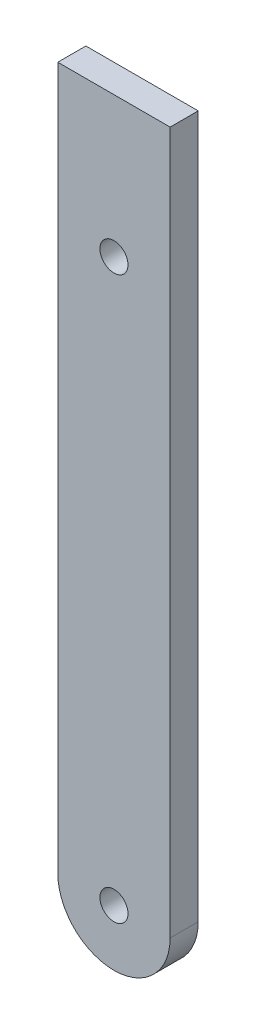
ISO-10303-21;
HEADER;
FILE_DESCRIPTION(('STEP AP214'),'2;1');
FILE_NAME('part.step','',(''),(''),'','','');
FILE_SCHEMA(('AUTOMOTIVE_DESIGN { 1 0 10303 214 1 1 1 1 }'));
ENDSEC;
DATA;
#1=APPLICATION_CONTEXT('core data for automotive mechanical design processes');
#2=APPLICATION_PROTOCOL_DEFINITION('international standard','automotive_design',2000,#1);
#3=PRODUCT_CONTEXT('',#1,'mechanical');
#4=PRODUCT('Part','Part','',(#3));
#5=PRODUCT_RELATED_PRODUCT_CATEGORY('part','',(#4));
#6=PRODUCT_DEFINITION_FORMATION('','',#4);
#7=PRODUCT_DEFINITION_CONTEXT('part definition',#1,'design');
#8=PRODUCT_DEFINITION('design','',#6,#7);
#9=PRODUCT_DEFINITION_SHAPE('','',#8);
#10=(LENGTH_UNIT() NAMED_UNIT(*) SI_UNIT(.MILLI.,.METRE.));
#11=(NAMED_UNIT(*) PLANE_ANGLE_UNIT() SI_UNIT($,.RADIAN.));
#12=(NAMED_UNIT(*) SI_UNIT($,.STERADIAN.) SOLID_ANGLE_UNIT());
#13=UNCERTAINTY_MEASURE_WITH_UNIT(LENGTH_MEASURE(1.E-05),#10,'distance_accuracy_value','');
#14=(GEOMETRIC_REPRESENTATION_CONTEXT(3) GLOBAL_UNCERTAINTY_ASSIGNED_CONTEXT((#13)) GLOBAL_UNIT_ASSIGNED_CONTEXT((#10,
#11,#12)) REPRESENTATION_CONTEXT('',''));
#15=CARTESIAN_POINT('',(0.,0.,0.));
#16=DIRECTION('',(0.,0.,1.));
#17=DIRECTION('',(1.,0.,0.));
#18=AXIS2_PLACEMENT_3D('',#15,#16,#17);
#19=CARTESIAN_POINT('',(0.,0.,5.));
#20=DIRECTION('',(0.,0.,1.));
#21=DIRECTION('',(1.,0.,0.));
#22=AXIS2_PLACEMENT_3D('',#19,#20,#21);
#23=PLANE('',#22);
#24=CARTESIAN_POINT('',(0.,100.,5.));
#25=DIRECTION('',(0.,0.,1.));
#26=DIRECTION('',(1.,0.,0.));
#27=AXIS2_PLACEMENT_3D('',#24,#25,#26);
#28=CIRCLE('',#27,2.5);
#29=CARTESIAN_POINT('',(2.5,100.,5.));
#30=VERTEX_POINT('',#29);
#31=EDGE_CURVE('E103',#30,#30,#28,.T.);
#32=ORIENTED_EDGE('',*,*,#31,.F.);
#33=EDGE_LOOP('',(#32));
#34=FACE_BOUND('',#33,.T.);
#35=CARTESIAN_POINT('',(0.,0.,5.));
#36=DIRECTION('',(0.,0.,1.));
#37=DIRECTION('',(1.,0.,0.));
#38=AXIS2_PLACEMENT_3D('',#35,#36,#37);
#39=CIRCLE('',#38,10.);
#40=CARTESIAN_POINT('',(-10.,0.,5.));
#41=VERTEX_POINT('',#40);
#42=CARTESIAN_POINT('',(10.,0.,5.));
#43=VERTEX_POINT('',#42);
#44=EDGE_CURVE('E88',#41,#43,#39,.T.);
#45=ORIENTED_EDGE('',*,*,#44,.T.);
#46=DIRECTION('',(0.,1.,0.));
#47=VECTOR('',#46,1.);
#48=CARTESIAN_POINT('',(10.,125.,5.));
#49=LINE('',#48,#47);
#50=CARTESIAN_POINT('',(10.,125.,5.));
#51=VERTEX_POINT('',#50);
#52=EDGE_CURVE('E83',#43,#51,#49,.T.);
#53=ORIENTED_EDGE('',*,*,#52,.T.);
#54=DIRECTION('',(-1.,0.,0.));
#55=VECTOR('',#54,1.);
#56=CARTESIAN_POINT('',(-10.,125.,5.));
#57=LINE('',#56,#55);
#58=CARTESIAN_POINT('',(-10.,125.,5.));
#59=VERTEX_POINT('',#58);
#60=EDGE_CURVE('E86',#51,#59,#57,.T.);
#61=ORIENTED_EDGE('',*,*,#60,.T.);
#62=DIRECTION('',(0.,-1.,0.));
#63=VECTOR('',#62,1.);
#64=CARTESIAN_POINT('',(-10.,0.,5.));
#65=LINE('',#64,#63);
#66=EDGE_CURVE('E53',#59,#41,#65,.T.);
#67=ORIENTED_EDGE('',*,*,#66,.T.);
#68=EDGE_LOOP('',(#45,#53,#61,#67));
#69=FACE_BOUND('',#68,.T.);
#70=CARTESIAN_POINT('',(0.,0.,5.));
#71=DIRECTION('',(0.,0.,1.));
#72=DIRECTION('',(1.,0.,0.));
#73=AXIS2_PLACEMENT_3D('',#70,#71,#72);
#74=CIRCLE('',#73,2.5);
#75=CARTESIAN_POINT('',(2.5,0.,5.));
#76=VERTEX_POINT('',#75);
#77=EDGE_CURVE('E118',#76,#76,#74,.T.);
#78=ORIENTED_EDGE('',*,*,#77,.F.);
#79=EDGE_LOOP('',(#78));
#80=FACE_BOUND('',#79,.T.);
#81=ADVANCED_FACE('F36',(#34,#69,#80),#23,.T.);
#82=CARTESIAN_POINT('',(0.,0.,0.));
#83=DIRECTION('',(0.,0.,1.));
#84=DIRECTION('',(1.,0.,0.));
#85=AXIS2_PLACEMENT_3D('',#82,#83,#84);
#86=PLANE('',#85);
#87=CARTESIAN_POINT('',(0.,0.,0.));
#88=DIRECTION('',(0.,0.,1.));
#89=DIRECTION('',(1.,0.,0.));
#90=AXIS2_PLACEMENT_3D('',#87,#88,#89);
#91=CIRCLE('',#90,10.);
#92=CARTESIAN_POINT('',(-10.,0.,0.));
#93=VERTEX_POINT('',#92);
#94=CARTESIAN_POINT('',(10.,0.,0.));
#95=VERTEX_POINT('',#94);
#96=EDGE_CURVE('E100',#93,#95,#91,.T.);
#97=ORIENTED_EDGE('',*,*,#96,.F.);
#98=DIRECTION('',(0.,-1.,0.));
#99=VECTOR('',#98,1.);
#100=CARTESIAN_POINT('',(-10.,0.,0.));
#101=LINE('',#100,#99);
#102=CARTESIAN_POINT('',(-10.,125.,0.));
#103=VERTEX_POINT('',#102);
#104=EDGE_CURVE('E76',#103,#93,#101,.T.);
#105=ORIENTED_EDGE('',*,*,#104,.F.);
#106=DIRECTION('',(-1.,0.,0.));
#107=VECTOR('',#106,1.);
#108=CARTESIAN_POINT('',(-10.,125.,0.));
#109=LINE('',#108,#107);
#110=CARTESIAN_POINT('',(10.,125.,0.));
#111=VERTEX_POINT('',#110);
#112=EDGE_CURVE('E70',#111,#103,#109,.T.);
#113=ORIENTED_EDGE('',*,*,#112,.F.);
#114=DIRECTION('',(0.,1.,0.));
#115=VECTOR('',#114,1.);
#116=CARTESIAN_POINT('',(10.,125.,0.));
#117=LINE('',#116,#115);
#118=EDGE_CURVE('E92',#95,#111,#117,.T.);
#119=ORIENTED_EDGE('',*,*,#118,.F.);
#120=EDGE_LOOP('',(#97,#105,#113,#119));
#121=FACE_BOUND('',#120,.T.);
#122=CARTESIAN_POINT('',(0.,100.,0.));
#123=DIRECTION('',(0.,0.,1.));
#124=DIRECTION('',(1.,0.,0.));
#125=AXIS2_PLACEMENT_3D('',#122,#123,#124);
#126=CIRCLE('',#125,2.5);
#127=CARTESIAN_POINT('',(2.5,100.,0.));
#128=VERTEX_POINT('',#127);
#129=EDGE_CURVE('E115',#128,#128,#126,.T.);
#130=ORIENTED_EDGE('',*,*,#129,.T.);
#131=EDGE_LOOP('',(#130));
#132=FACE_BOUND('',#131,.T.);
#133=CARTESIAN_POINT('',(0.,0.,0.));
#134=DIRECTION('',(0.,0.,1.));
#135=DIRECTION('',(1.,0.,0.));
#136=AXIS2_PLACEMENT_3D('',#133,#134,#135);
#137=CIRCLE('',#136,2.5);
#138=CARTESIAN_POINT('',(2.5,0.,0.));
#139=VERTEX_POINT('',#138);
#140=EDGE_CURVE('E121',#139,#139,#137,.T.);
#141=ORIENTED_EDGE('',*,*,#140,.T.);
#142=EDGE_LOOP('',(#141));
#143=FACE_BOUND('',#142,.T.);
#144=ADVANCED_FACE('F111',(#121,#132,#143),#86,.F.);
#145=CARTESIAN_POINT('',(0.,0.,5.));
#146=DIRECTION('',(0.,0.,-1.));
#147=DIRECTION('',(-1.,0.,0.));
#148=AXIS2_PLACEMENT_3D('',#145,#146,#147);
#149=CYLINDRICAL_SURFACE('',#148,10.);
#150=ORIENTED_EDGE('',*,*,#96,.T.);
#151=DIRECTION('',(0.,0.,-1.));
#152=VECTOR('',#151,1.);
#153=CARTESIAN_POINT('',(10.,0.,5.));
#154=LINE('',#153,#152);
#155=EDGE_CURVE('E11',#43,#95,#154,.T.);
#156=ORIENTED_EDGE('',*,*,#155,.F.);
#157=ORIENTED_EDGE('',*,*,#44,.F.);
#158=DIRECTION('',(0.,0.,-1.));
#159=VECTOR('',#158,1.);
#160=CARTESIAN_POINT('',(-10.,0.,5.));
#161=LINE('',#160,#159);
#162=EDGE_CURVE('E96',#41,#93,#161,.T.);
#163=ORIENTED_EDGE('',*,*,#162,.T.);
#164=EDGE_LOOP('',(#150,#156,#157,#163));
#165=FACE_BOUND('',#164,.T.);
#166=ADVANCED_FACE('F38',(#165),#149,.T.);
#167=CARTESIAN_POINT('',(10.,125.,5.));
#168=DIRECTION('',(-1.,0.,0.));
#169=DIRECTION('',(0.,0.,1.));
#170=AXIS2_PLACEMENT_3D('',#167,#168,#169);
#171=PLANE('',#170);
#172=ORIENTED_EDGE('',*,*,#118,.T.);
#173=DIRECTION('',(0.,0.,-1.));
#174=VECTOR('',#173,1.);
#175=CARTESIAN_POINT('',(10.,125.,5.));
#176=LINE('',#175,#174);
#177=EDGE_CURVE('E45',#51,#111,#176,.T.);
#178=ORIENTED_EDGE('',*,*,#177,.F.);
#179=ORIENTED_EDGE('',*,*,#52,.F.);
#180=ORIENTED_EDGE('',*,*,#155,.T.);
#181=EDGE_LOOP('',(#172,#178,#179,#180));
#182=FACE_BOUND('',#181,.T.);
#183=ADVANCED_FACE('F91',(#182),#171,.F.);
#184=CARTESIAN_POINT('',(-10.,125.,5.));
#185=DIRECTION('',(0.,-1.,0.));
#186=DIRECTION('',(0.,0.,-1.));
#187=AXIS2_PLACEMENT_3D('',#184,#185,#186);
#188=PLANE('',#187);
#189=ORIENTED_EDGE('',*,*,#112,.T.);
#190=DIRECTION('',(0.,0.,-1.));
#191=VECTOR('',#190,1.);
#192=CARTESIAN_POINT('',(-10.,125.,5.));
#193=LINE('',#192,#191);
#194=EDGE_CURVE('E93',#59,#103,#193,.T.);
#195=ORIENTED_EDGE('',*,*,#194,.F.);
#196=ORIENTED_EDGE('',*,*,#60,.F.);
#197=ORIENTED_EDGE('',*,*,#177,.T.);
#198=EDGE_LOOP('',(#189,#195,#196,#197));
#199=FACE_BOUND('',#198,.T.);
#200=ADVANCED_FACE('F94',(#199),#188,.F.);
#201=CARTESIAN_POINT('',(-10.,0.,5.));
#202=DIRECTION('',(1.,0.,0.));
#203=DIRECTION('',(0.,0.,-1.));
#204=AXIS2_PLACEMENT_3D('',#201,#202,#203);
#205=PLANE('',#204);
#206=ORIENTED_EDGE('',*,*,#104,.T.);
#207=ORIENTED_EDGE('',*,*,#162,.F.);
#208=ORIENTED_EDGE('',*,*,#66,.F.);
#209=ORIENTED_EDGE('',*,*,#194,.T.);
#210=EDGE_LOOP('',(#206,#207,#208,#209));
#211=FACE_BOUND('',#210,.T.);
#212=ADVANCED_FACE('F108',(#211),#205,.F.);
#213=CARTESIAN_POINT('',(0.,100.,5.));
#214=DIRECTION('',(0.,0.,-1.));
#215=DIRECTION('',(-1.,0.,0.));
#216=AXIS2_PLACEMENT_3D('',#213,#214,#215);
#217=CYLINDRICAL_SURFACE('',#216,2.5);
#218=ORIENTED_EDGE('',*,*,#31,.T.);
#219=EDGE_LOOP('',(#218));
#220=FACE_BOUND('',#219,.T.);
#221=ORIENTED_EDGE('',*,*,#129,.F.);
#222=EDGE_LOOP('',(#221));
#223=FACE_BOUND('',#222,.T.);
#224=ADVANCED_FACE('F138',(#220,#223),#217,.F.);
#225=CARTESIAN_POINT('',(0.,0.,5.));
#226=DIRECTION('',(0.,0.,-1.));
#227=DIRECTION('',(-1.,0.,0.));
#228=AXIS2_PLACEMENT_3D('',#225,#226,#227);
#229=CYLINDRICAL_SURFACE('',#228,2.5);
#230=ORIENTED_EDGE('',*,*,#77,.T.);
#231=EDGE_LOOP('',(#230));
#232=FACE_BOUND('',#231,.T.);
#233=ORIENTED_EDGE('',*,*,#140,.F.);
#234=EDGE_LOOP('',(#233));
#235=FACE_BOUND('',#234,.T.);
#236=ADVANCED_FACE('F127',(#232,#235),#229,.F.);
#237=CLOSED_SHELL('',(#81,#144,#166,#183,#200,#212,#224,#236));
#238=MANIFOLD_SOLID_BREP('B2',#237);
#239=ADVANCED_BREP_SHAPE_REPRESENTATION('',(#18,#238),#14);
#240=SHAPE_DEFINITION_REPRESENTATION(#9,#239);
ENDSEC;
END-ISO-10303-21;
